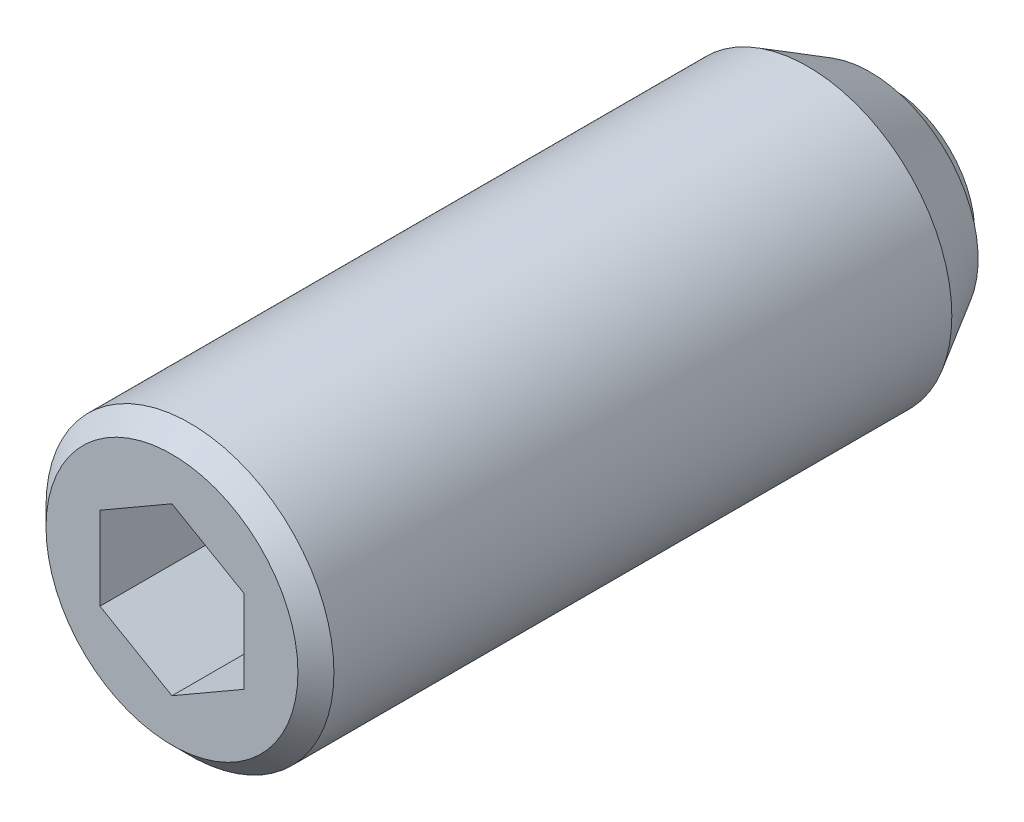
ISO-10303-21;
HEADER;
FILE_DESCRIPTION(('STEP AP214'),'2;1');
FILE_NAME('part.step','',(''),(''),'','','');
FILE_SCHEMA(('AUTOMOTIVE_DESIGN { 1 0 10303 214 1 1 1 1 }'));
ENDSEC;
DATA;
#1=APPLICATION_CONTEXT('core data for automotive mechanical design processes');
#2=APPLICATION_PROTOCOL_DEFINITION('international standard','automotive_design',2000,#1);
#3=PRODUCT_CONTEXT('',#1,'mechanical');
#4=PRODUCT('Part','Part','',(#3));
#5=PRODUCT_RELATED_PRODUCT_CATEGORY('part','',(#4));
#6=PRODUCT_DEFINITION_FORMATION('','',#4);
#7=PRODUCT_DEFINITION_CONTEXT('part definition',#1,'design');
#8=PRODUCT_DEFINITION('design','',#6,#7);
#9=PRODUCT_DEFINITION_SHAPE('','',#8);
#10=(LENGTH_UNIT() NAMED_UNIT(*) SI_UNIT(.MILLI.,.METRE.));
#11=(NAMED_UNIT(*) PLANE_ANGLE_UNIT() SI_UNIT($,.RADIAN.));
#12=(NAMED_UNIT(*) SI_UNIT($,.STERADIAN.) SOLID_ANGLE_UNIT());
#13=UNCERTAINTY_MEASURE_WITH_UNIT(LENGTH_MEASURE(1.E-05),#10,'distance_accuracy_value','');
#14=(GEOMETRIC_REPRESENTATION_CONTEXT(3) GLOBAL_UNCERTAINTY_ASSIGNED_CONTEXT((#13)) GLOBAL_UNIT_ASSIGNED_CONTEXT((#10,
#11,#12)) REPRESENTATION_CONTEXT('',''));
#15=CARTESIAN_POINT('',(0.,0.,0.));
#16=DIRECTION('',(0.,0.,1.));
#17=DIRECTION('',(1.,0.,0.));
#18=AXIS2_PLACEMENT_3D('',#15,#16,#17);
#19=CARTESIAN_POINT('',(2.,1.15470053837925,17.5));
#20=DIRECTION('',(0.5,0.86602540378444,0.));
#21=DIRECTION('',(0.86602540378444,-0.5,0.));
#22=AXIS2_PLACEMENT_3D('',#19,#20,#21);
#23=PLANE('',#22);
#24=DIRECTION('',(0.,0.,1.));
#25=VECTOR('',#24,1.);
#26=CARTESIAN_POINT('',(2.,1.15470053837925,17.5));
#27=LINE('',#26,#25);
#28=CARTESIAN_POINT('',(2.,1.15470053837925,16.));
#29=VERTEX_POINT('',#28);
#30=CARTESIAN_POINT('',(2.,1.15470053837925,20.));
#31=VERTEX_POINT('',#30);
#32=EDGE_CURVE('E68',#29,#31,#27,.T.);
#33=ORIENTED_EDGE('',*,*,#32,.T.);
#34=DIRECTION('',(-0.86602540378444,0.5,0.));
#35=VECTOR('',#34,1.);
#36=CARTESIAN_POINT('',(2.,1.15470053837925,20.));
#37=LINE('',#36,#35);
#38=CARTESIAN_POINT('',(0.,2.3094010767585,20.));
#39=VERTEX_POINT('',#38);
#40=EDGE_CURVE('E29',#31,#39,#37,.T.);
#41=ORIENTED_EDGE('',*,*,#40,.T.);
#42=DIRECTION('',(0.,0.,1.));
#43=VECTOR('',#42,1.);
#44=CARTESIAN_POINT('',(0.,2.3094010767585,17.5));
#45=LINE('',#44,#43);
#46=CARTESIAN_POINT('',(0.,2.3094010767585,16.));
#47=VERTEX_POINT('',#46);
#48=EDGE_CURVE('E80',#47,#39,#45,.T.);
#49=ORIENTED_EDGE('',*,*,#48,.F.);
#50=DIRECTION('',(-0.86602540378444,0.5,0.));
#51=VECTOR('',#50,1.);
#52=CARTESIAN_POINT('',(2.,1.15470053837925,16.));
#53=LINE('',#52,#51);
#54=EDGE_CURVE('E79',#29,#47,#53,.T.);
#55=ORIENTED_EDGE('',*,*,#54,.F.);
#56=EDGE_LOOP('',(#33,#41,#49,#55));
#57=FACE_BOUND('',#56,.T.);
#58=ADVANCED_FACE('F14',(#57),#23,.F.);
#59=CARTESIAN_POINT('',(2.,-1.15470053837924,17.5));
#60=DIRECTION('',(1.,0.,0.));
#61=DIRECTION('',(0.,0.,1.));
#62=AXIS2_PLACEMENT_3D('',#59,#60,#61);
#63=PLANE('',#62);
#64=DIRECTION('',(0.,0.,1.));
#65=VECTOR('',#64,1.);
#66=CARTESIAN_POINT('',(2.,-1.15470053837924,17.5));
#67=LINE('',#66,#65);
#68=CARTESIAN_POINT('',(2.,-1.15470053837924,16.));
#69=VERTEX_POINT('',#68);
#70=CARTESIAN_POINT('',(2.,-1.15470053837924,20.));
#71=VERTEX_POINT('',#70);
#72=EDGE_CURVE('E76',#69,#71,#67,.T.);
#73=ORIENTED_EDGE('',*,*,#72,.T.);
#74=DIRECTION('',(0.,1.,0.));
#75=VECTOR('',#74,1.);
#76=CARTESIAN_POINT('',(2.,-1.15470053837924,20.));
#77=LINE('',#76,#75);
#78=EDGE_CURVE('E75',#71,#31,#77,.T.);
#79=ORIENTED_EDGE('',*,*,#78,.T.);
#80=ORIENTED_EDGE('',*,*,#32,.F.);
#81=DIRECTION('',(0.,1.,0.));
#82=VECTOR('',#81,1.);
#83=CARTESIAN_POINT('',(2.,-1.15470053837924,16.));
#84=LINE('',#83,#82);
#85=EDGE_CURVE('E72',#69,#29,#84,.T.);
#86=ORIENTED_EDGE('',*,*,#85,.F.);
#87=EDGE_LOOP('',(#73,#79,#80,#86));
#88=FACE_BOUND('',#87,.T.);
#89=ADVANCED_FACE('F70',(#88),#63,.F.);
#90=CARTESIAN_POINT('',(2.,-1.15470053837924,17.5));
#91=DIRECTION('',(-0.5,0.866025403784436,0.));
#92=DIRECTION('',(0.866025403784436,0.5,0.));
#93=AXIS2_PLACEMENT_3D('',#90,#91,#92);
#94=PLANE('',#93);
#95=DIRECTION('',(0.,0.,1.));
#96=VECTOR('',#95,1.);
#97=CARTESIAN_POINT('',(0.,-2.30940107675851,17.5));
#98=LINE('',#97,#96);
#99=CARTESIAN_POINT('',(0.,-2.30940107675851,16.));
#100=VERTEX_POINT('',#99);
#101=CARTESIAN_POINT('',(0.,-2.30940107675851,20.));
#102=VERTEX_POINT('',#101);
#103=EDGE_CURVE('E122',#100,#102,#98,.T.);
#104=ORIENTED_EDGE('',*,*,#103,.T.);
#105=DIRECTION('',(-0.866025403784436,-0.5,0.));
#106=VECTOR('',#105,1.);
#107=CARTESIAN_POINT('',(2.,-1.15470053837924,20.));
#108=LINE('',#107,#106);
#109=EDGE_CURVE('E113',#71,#102,#108,.T.);
#110=ORIENTED_EDGE('',*,*,#109,.F.);
#111=ORIENTED_EDGE('',*,*,#72,.F.);
#112=DIRECTION('',(0.866025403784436,0.5,0.));
#113=VECTOR('',#112,1.);
#114=CARTESIAN_POINT('',(0.,-2.30940107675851,16.));
#115=LINE('',#114,#113);
#116=EDGE_CURVE('E89',#100,#69,#115,.T.);
#117=ORIENTED_EDGE('',*,*,#116,.F.);
#118=EDGE_LOOP('',(#104,#110,#111,#117));
#119=FACE_BOUND('',#118,.T.);
#120=ADVANCED_FACE('F147',(#119),#94,.T.);
#121=CARTESIAN_POINT('',(-2.,-1.15470053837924,17.5));
#122=DIRECTION('',(-0.5,-0.866025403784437,0.));
#123=DIRECTION('',(-0.866025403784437,0.5,0.));
#124=AXIS2_PLACEMENT_3D('',#121,#122,#123);
#125=PLANE('',#124);
#126=DIRECTION('',(0.,0.,1.));
#127=VECTOR('',#126,1.);
#128=CARTESIAN_POINT('',(-2.,-1.15470053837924,17.5));
#129=LINE('',#128,#127);
#130=CARTESIAN_POINT('',(-2.,-1.15470053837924,16.));
#131=VERTEX_POINT('',#130);
#132=CARTESIAN_POINT('',(-2.,-1.15470053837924,20.));
#133=VERTEX_POINT('',#132);
#134=EDGE_CURVE('E120',#131,#133,#129,.T.);
#135=ORIENTED_EDGE('',*,*,#134,.T.);
#136=DIRECTION('',(0.866025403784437,-0.5,0.));
#137=VECTOR('',#136,1.);
#138=CARTESIAN_POINT('',(-2.,-1.15470053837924,20.));
#139=LINE('',#138,#137);
#140=EDGE_CURVE('E111',#133,#102,#139,.T.);
#141=ORIENTED_EDGE('',*,*,#140,.T.);
#142=ORIENTED_EDGE('',*,*,#103,.F.);
#143=DIRECTION('',(0.866025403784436,-0.5,0.));
#144=VECTOR('',#143,1.);
#145=CARTESIAN_POINT('',(-2.,-1.15470053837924,16.));
#146=LINE('',#145,#144);
#147=EDGE_CURVE('E101',#131,#100,#146,.T.);
#148=ORIENTED_EDGE('',*,*,#147,.F.);
#149=EDGE_LOOP('',(#135,#141,#142,#148));
#150=FACE_BOUND('',#149,.T.);
#151=ADVANCED_FACE('F157',(#150),#125,.F.);
#152=CARTESIAN_POINT('',(-2.,-1.15470053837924,17.5));
#153=DIRECTION('',(1.,0.,0.));
#154=DIRECTION('',(0.,0.,1.));
#155=AXIS2_PLACEMENT_3D('',#152,#153,#154);
#156=PLANE('',#155);
#157=DIRECTION('',(0.,0.,1.));
#158=VECTOR('',#157,1.);
#159=CARTESIAN_POINT('',(-2.,1.15470053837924,17.5));
#160=LINE('',#159,#158);
#161=CARTESIAN_POINT('',(-2.,1.15470053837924,16.));
#162=VERTEX_POINT('',#161);
#163=CARTESIAN_POINT('',(-2.,1.15470053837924,20.));
#164=VERTEX_POINT('',#163);
#165=EDGE_CURVE('E37',#162,#164,#160,.T.);
#166=ORIENTED_EDGE('',*,*,#165,.T.);
#167=DIRECTION('',(0.,1.,0.));
#168=VECTOR('',#167,1.);
#169=CARTESIAN_POINT('',(-2.,-1.15470053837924,20.));
#170=LINE('',#169,#168);
#171=EDGE_CURVE('E108',#133,#164,#170,.T.);
#172=ORIENTED_EDGE('',*,*,#171,.F.);
#173=ORIENTED_EDGE('',*,*,#134,.F.);
#174=DIRECTION('',(0.,-1.,0.));
#175=VECTOR('',#174,1.);
#176=CARTESIAN_POINT('',(-2.,1.15470053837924,16.));
#177=LINE('',#176,#175);
#178=EDGE_CURVE('E98',#162,#131,#177,.T.);
#179=ORIENTED_EDGE('',*,*,#178,.F.);
#180=EDGE_LOOP('',(#166,#172,#173,#179));
#181=FACE_BOUND('',#180,.T.);
#182=ADVANCED_FACE('F153',(#181),#156,.T.);
#183=CARTESIAN_POINT('',(-2.,1.15470053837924,17.5));
#184=DIRECTION('',(0.5,-0.866025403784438,0.));
#185=DIRECTION('',(-0.866025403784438,-0.5,0.));
#186=AXIS2_PLACEMENT_3D('',#183,#184,#185);
#187=PLANE('',#186);
#188=ORIENTED_EDGE('',*,*,#165,.F.);
#189=DIRECTION('',(-0.866025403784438,-0.5,0.));
#190=VECTOR('',#189,1.);
#191=CARTESIAN_POINT('',(0.,2.3094010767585,16.));
#192=LINE('',#191,#190);
#193=EDGE_CURVE('E84',#47,#162,#192,.T.);
#194=ORIENTED_EDGE('',*,*,#193,.F.);
#195=ORIENTED_EDGE('',*,*,#48,.T.);
#196=DIRECTION('',(0.866025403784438,0.5,0.));
#197=VECTOR('',#196,1.);
#198=CARTESIAN_POINT('',(-2.,1.15470053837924,20.));
#199=LINE('',#198,#197);
#200=EDGE_CURVE('E105',#164,#39,#199,.T.);
#201=ORIENTED_EDGE('',*,*,#200,.F.);
#202=EDGE_LOOP('',(#188,#194,#195,#201));
#203=FACE_BOUND('',#202,.T.);
#204=ADVANCED_FACE('F150',(#203),#187,.T.);
#205=CARTESIAN_POINT('',(0.,0.,19.75));
#206=DIRECTION('',(0.,0.,-1.));
#207=DIRECTION('',(1.,0.,0.));
#208=AXIS2_PLACEMENT_3D('',#205,#206,#207);
#209=CYLINDRICAL_SURFACE('',#208,4.);
#210=CARTESIAN_POINT('',(0.,0.,19.5));
#211=DIRECTION('',(0.,0.,-1.));
#212=DIRECTION('',(1.,0.,0.));
#213=AXIS2_PLACEMENT_3D('',#210,#211,#212);
#214=CIRCLE('',#213,4.);
#215=CARTESIAN_POINT('',(4.,0.,19.5));
#216=VERTEX_POINT('',#215);
#217=EDGE_CURVE('E9',#216,#216,#214,.T.);
#218=ORIENTED_EDGE('',*,*,#217,.T.);
#219=EDGE_LOOP('',(#218));
#220=FACE_BOUND('',#219,.T.);
#221=CARTESIAN_POINT('',(0.,0.,2.33205080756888));
#222=DIRECTION('',(0.,0.,-1.));
#223=DIRECTION('',(-1.,0.,0.));
#224=AXIS2_PLACEMENT_3D('',#221,#222,#223);
#225=CIRCLE('',#224,4.);
#226=CARTESIAN_POINT('',(-4.,0.,2.33205080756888));
#227=VERTEX_POINT('',#226);
#228=EDGE_CURVE('E260',#227,#227,#225,.T.);
#229=ORIENTED_EDGE('',*,*,#228,.F.);
#230=EDGE_LOOP('',(#229));
#231=FACE_BOUND('',#230,.T.);
#232=ADVANCED_FACE('F16',(#220,#231),#209,.T.);
#233=CARTESIAN_POINT('',(0.,0.,19.5));
#234=DIRECTION('',(0.,0.,-1.));
#235=DIRECTION('',(1.,0.,0.));
#236=AXIS2_PLACEMENT_3D('',#233,#234,#235);
#237=CONICAL_SURFACE('',#236,4.,0.785398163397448);
#238=CARTESIAN_POINT('',(0.,0.,20.));
#239=DIRECTION('',(0.,0.,-1.));
#240=DIRECTION('',(1.,0.,0.));
#241=AXIS2_PLACEMENT_3D('',#238,#239,#240);
#242=CIRCLE('',#241,3.5);
#243=CARTESIAN_POINT('',(3.5,0.,20.));
#244=VERTEX_POINT('',#243);
#245=EDGE_CURVE('E22',#244,#244,#242,.T.);
#246=ORIENTED_EDGE('',*,*,#245,.T.);
#247=EDGE_LOOP('',(#246));
#248=FACE_BOUND('',#247,.T.);
#249=ORIENTED_EDGE('',*,*,#217,.F.);
#250=EDGE_LOOP('',(#249));
#251=FACE_BOUND('',#250,.T.);
#252=ADVANCED_FACE('F127',(#248,#251),#237,.T.);
#253=CARTESIAN_POINT('',(0.,0.,20.));
#254=DIRECTION('',(0.,0.,-1.));
#255=DIRECTION('',(1.,0.,0.));
#256=AXIS2_PLACEMENT_3D('',#253,#254,#255);
#257=PLANE('',#256);
#258=ORIENTED_EDGE('',*,*,#200,.T.);
#259=ORIENTED_EDGE('',*,*,#40,.F.);
#260=ORIENTED_EDGE('',*,*,#78,.F.);
#261=ORIENTED_EDGE('',*,*,#109,.T.);
#262=ORIENTED_EDGE('',*,*,#140,.F.);
#263=ORIENTED_EDGE('',*,*,#171,.T.);
#264=EDGE_LOOP('',(#258,#259,#260,#261,#262,#263));
#265=FACE_BOUND('',#264,.T.);
#266=ORIENTED_EDGE('',*,*,#245,.F.);
#267=EDGE_LOOP('',(#266));
#268=FACE_BOUND('',#267,.T.);
#269=ADVANCED_FACE('F130',(#265,#268),#257,.F.);
#270=CARTESIAN_POINT('',(2.,1.15470053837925,16.));
#271=DIRECTION('',(0.,0.,1.));
#272=DIRECTION('',(1.,0.,0.));
#273=AXIS2_PLACEMENT_3D('',#270,#271,#272);
#274=PLANE('',#273);
#275=ORIENTED_EDGE('',*,*,#85,.T.);
#276=ORIENTED_EDGE('',*,*,#54,.T.);
#277=ORIENTED_EDGE('',*,*,#193,.T.);
#278=ORIENTED_EDGE('',*,*,#178,.T.);
#279=ORIENTED_EDGE('',*,*,#147,.T.);
#280=ORIENTED_EDGE('',*,*,#116,.T.);
#281=EDGE_LOOP('',(#275,#276,#277,#278,#279,#280));
#282=FACE_BOUND('',#281,.T.);
#283=ADVANCED_FACE('F86',(#282),#274,.T.);
#284=CARTESIAN_POINT('',(0.,0.,0.));
#285=DIRECTION('',(0.,0.,-1.));
#286=DIRECTION('',(-1.,0.,0.));
#287=AXIS2_PLACEMENT_3D('',#284,#285,#286);
#288=PLANE('',#287);
#289=CARTESIAN_POINT('',(0.,0.,0.));
#290=DIRECTION('',(0.,0.,-1.));
#291=DIRECTION('',(-1.,0.,0.));
#292=AXIS2_PLACEMENT_3D('',#289,#290,#291);
#293=CIRCLE('',#292,2.30488611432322);
#294=CARTESIAN_POINT('',(-2.30488611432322,0.,0.));
#295=VERTEX_POINT('',#294);
#296=EDGE_CURVE('E90',#295,#295,#293,.T.);
#297=ORIENTED_EDGE('',*,*,#296,.T.);
#298=EDGE_LOOP('',(#297));
#299=FACE_BOUND('',#298,.T.);
#300=ADVANCED_FACE('F139',(#299),#288,.T.);
#301=CARTESIAN_POINT('',(0.,0.,1.5));
#302=DIRECTION('',(0.,0.,-1.));
#303=DIRECTION('',(-1.,0.,0.));
#304=AXIS2_PLACEMENT_3D('',#301,#302,#303);
#305=SPHERICAL_SURFACE('',#304,2.75);
#306=CARTESIAN_POINT('',(0.,0.,0.6));
#307=DIRECTION('',(0.,0.,-1.));
#308=DIRECTION('',(-1.,0.,0.));
#309=AXIS2_PLACEMENT_3D('',#306,#307,#308);
#310=CIRCLE('',#309,2.59855729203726);
#311=CARTESIAN_POINT('',(-2.59855729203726,0.,0.6));
#312=VERTEX_POINT('',#311);
#313=EDGE_CURVE('E93',#312,#312,#310,.T.);
#314=CARTESIAN_POINT('',(-2.59855729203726,0.,0.6));
#315=CARTESIAN_POINT('',(-2.59627433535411,0.,0.593408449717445));
#316=CARTESIAN_POINT('',(-2.59396629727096,0.,0.586825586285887));
#317=CARTESIAN_POINT('',(-2.58930019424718,0.,0.573677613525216));
#318=CARTESIAN_POINT('',(-2.58694212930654,0.,0.567112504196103));
#319=CARTESIAN_POINT('',(-2.58217610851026,0.,0.55400042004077));
#320=CARTESIAN_POINT('',(-2.57976815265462,0.,0.54745344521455));
#321=CARTESIAN_POINT('',(-2.57490248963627,0.,0.534378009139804));
#322=CARTESIAN_POINT('',(-2.57244478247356,0.,0.527849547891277));
#323=CARTESIAN_POINT('',(-2.56747975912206,0.,0.514811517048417));
#324=CARTESIAN_POINT('',(-2.56497244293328,0.,0.508301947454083));
#325=CARTESIAN_POINT('',(-2.55990834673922,0.,0.495302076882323));
#326=CARTESIAN_POINT('',(-2.55735156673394,0.,0.488811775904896));
#327=CARTESIAN_POINT('',(-2.55218869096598,0.,0.475850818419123));
#328=CARTESIAN_POINT('',(-2.54958259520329,0.,0.469380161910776));
#329=CARTESIAN_POINT('',(-2.54432123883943,0.,0.456458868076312));
#330=CARTESIAN_POINT('',(-2.54166597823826,0.,0.450008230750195));
#331=CARTESIAN_POINT('',(-2.53630644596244,0.,0.437127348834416));
#332=CARTESIAN_POINT('',(-2.53360217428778,0.,0.430697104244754));
#333=CARTESIAN_POINT('',(-2.52814477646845,0.,0.417857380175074));
#334=CARTESIAN_POINT('',(-2.52539165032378,0.,0.411447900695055));
#335=CARTESIAN_POINT('',(-2.51983670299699,0.,0.398650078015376));
#336=CARTESIAN_POINT('',(-2.51703488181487,0.,0.392261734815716));
#337=CARTESIAN_POINT('',(-2.51138270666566,0.,0.379506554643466));
#338=CARTESIAN_POINT('',(-2.50853235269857,0.,0.373139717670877));
#339=CARTESIAN_POINT('',(-2.50278327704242,0.,0.360427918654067));
#340=CARTESIAN_POINT('',(-2.49988455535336,0.,0.354082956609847));
#341=CARTESIAN_POINT('',(-2.49403891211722,0.,0.3414152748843));
#342=CARTESIAN_POINT('',(-2.49109199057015,0.,0.335092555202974));
#343=CARTESIAN_POINT('',(-2.48515011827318,0.,0.322469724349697));
#344=CARTESIAN_POINT('',(-2.48215516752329,0.,0.316169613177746));
#345=CARTESIAN_POINT('',(-2.47611741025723,0.,0.303592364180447));
#346=CARTESIAN_POINT('',(-2.47307460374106,0.,0.2973152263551));
#347=CARTESIAN_POINT('',(-2.46694131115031,0.,0.284784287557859));
#348=CARTESIAN_POINT('',(-2.46385082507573,0.,0.278530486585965));
#349=CARTESIAN_POINT('',(-2.45762235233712,0.,0.266046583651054));
#350=CARTESIAN_POINT('',(-2.45448436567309,0.,0.259816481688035));
#351=CARTESIAN_POINT('',(-2.44816107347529,0.,0.247380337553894));
#352=CARTESIAN_POINT('',(-2.44497576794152,0.,0.241174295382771));
#353=CARTESIAN_POINT('',(-2.43855802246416,0.,0.228786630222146));
#354=CARTESIAN_POINT('',(-2.43532558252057,0.,0.222605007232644));
#355=CARTESIAN_POINT('',(-2.42881375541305,0.,0.210266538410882));
#356=CARTESIAN_POINT('',(-2.42553436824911,0.,0.204109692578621));
#357=CARTESIAN_POINT('',(-2.41892883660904,0.,0.191821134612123));
#358=CARTESIAN_POINT('',(-2.41560269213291,0.,0.185689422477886));
#359=CARTESIAN_POINT('',(-2.40890383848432,0.,0.173451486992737));
#360=CARTESIAN_POINT('',(-2.40553112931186,0.,0.167345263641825));
#361=CARTESIAN_POINT('',(-2.39873934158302,0.,0.155158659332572));
#362=CARTESIAN_POINT('',(-2.39532026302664,0.,0.149078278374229));
#363=CARTESIAN_POINT('',(-2.38843593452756,0.,0.136943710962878));
#364=CARTESIAN_POINT('',(-2.38497068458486,0.,0.13088952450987));
#365=CARTESIAN_POINT('',(-2.37799421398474,0.,0.11880769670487));
#366=CARTESIAN_POINT('',(-2.37448299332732,0.,0.11278005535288));
#367=CARTESIAN_POINT('',(-2.36741478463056,0.,0.100751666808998));
#368=CARTESIAN_POINT('',(-2.36385779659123,0.,0.094750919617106));
#369=CARTESIAN_POINT('',(-2.35669825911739,0.,0.0827766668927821));
#370=CARTESIAN_POINT('',(-2.35309570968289,0.,0.0768031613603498));
#371=CARTESIAN_POINT('',(-2.34584525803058,0.,0.0648837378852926));
#372=CARTESIAN_POINT('',(-2.34219735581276,0.,0.0589378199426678));
#373=CARTESIAN_POINT('',(-2.33485640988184,0.,0.0470739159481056));
#374=CARTESIAN_POINT('',(-2.33116336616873,0.,0.0411559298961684));
#375=CARTESIAN_POINT('',(-2.32373235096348,0.,0.0293482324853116));
#376=CARTESIAN_POINT('',(-2.31999437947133,0.,0.023458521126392));
#377=CARTESIAN_POINT('',(-2.31247372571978,0.,0.0117077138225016));
#378=CARTESIAN_POINT('',(-2.30869104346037,0.,0.00584661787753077));
#379=CARTESIAN_POINT('',(-2.30488611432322,0.,0.));
#380=B_SPLINE_CURVE_WITH_KNOTS('',3,(#314,#315,#316,#317,#318,#319,#320,#321,#322,#323,#324,
#325,#326,#327,#328,#329,#330,#331,#332,#333,#334,#335,#336,#337,#338,#339,#340,#341,#342,#343,
#344,#345,#346,#347,#348,#349,#350,#351,#352,#353,#354,#355,#356,#357,#358,#359,#360,#361,#362,
#363,#364,#365,#366,#367,#368,#369,#370,#371,#372,#373,#374,#375,#376,#377,#378,#379),
.UNSPECIFIED.,.F.,.F.,(4,2,2,2,2,2,2,2,2,2,2,2,2,2,2,2,2,2,2,2,2,2,2,2,2,2,2,2,2,2,2,2,4),(0.,
0.0209270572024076,0.0418541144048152,0.0627811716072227,0.0837082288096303,0.104635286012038,
0.125562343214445,0.146489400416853,0.16741645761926,0.188343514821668,0.209270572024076,
0.230197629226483,0.251124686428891,0.272051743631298,0.292978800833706,0.313905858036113,
0.334832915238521,0.355759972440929,0.376687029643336,0.397614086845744,0.418541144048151,
0.439468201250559,0.460395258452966,0.481322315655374,0.502249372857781,0.523176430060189,
0.544103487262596,0.565030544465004,0.585957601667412,0.606884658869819,0.627811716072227,
0.648738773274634,0.669665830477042),.UNSPECIFIED.);
#381=EDGE_CURVE('BSEAM223',#312,#295,#380,.T.);
#382=ORIENTED_EDGE('',*,*,#313,.T.);
#383=ORIENTED_EDGE('',*,*,#296,.F.);
#384=ORIENTED_EDGE('',*,*,#381,.T.);
#385=ORIENTED_EDGE('',*,*,#381,.F.);
#386=EDGE_LOOP('',(#382,#384,#383,#385));
#387=FACE_BOUND('',#386,.T.);
#388=ADVANCED_FACE('F223',(#387),#305,.T.);
#389=CARTESIAN_POINT('',(-2.59855729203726,0.,0.6));
#390=DIRECTION('',(0.,0.,-1.));
#391=DIRECTION('',(-1.,0.,0.));
#392=AXIS2_PLACEMENT_3D('',#389,#390,#391);
#393=PLANE('',#392);
#394=CARTESIAN_POINT('',(0.,0.,0.6));
#395=DIRECTION('',(0.,0.,-1.));
#396=DIRECTION('',(-1.,0.,0.));
#397=AXIS2_PLACEMENT_3D('',#394,#395,#396);
#398=CIRCLE('',#397,3.);
#399=CARTESIAN_POINT('',(-3.,0.,0.6));
#400=VERTEX_POINT('',#399);
#401=EDGE_CURVE('E263',#400,#400,#398,.T.);
#402=ORIENTED_EDGE('',*,*,#401,.T.);
#403=EDGE_LOOP('',(#402));
#404=FACE_BOUND('',#403,.T.);
#405=ORIENTED_EDGE('',*,*,#313,.F.);
#406=EDGE_LOOP('',(#405));
#407=FACE_BOUND('',#406,.T.);
#408=ADVANCED_FACE('F232',(#404,#407),#393,.T.);
#409=CARTESIAN_POINT('',(0.,0.,0.6));
#410=DIRECTION('',(0.,0.,1.));
#411=DIRECTION('',(1.,0.,0.));
#412=AXIS2_PLACEMENT_3D('',#409,#410,#411);
#413=CONICAL_SURFACE('',#412,3.,0.523598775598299);
#414=ORIENTED_EDGE('',*,*,#228,.T.);
#415=EDGE_LOOP('',(#414));
#416=FACE_BOUND('',#415,.T.);
#417=ORIENTED_EDGE('',*,*,#401,.F.);
#418=EDGE_LOOP('',(#417));
#419=FACE_BOUND('',#418,.T.);
#420=ADVANCED_FACE('F242',(#416,#419),#413,.T.);
#421=CLOSED_SHELL('',(#58,#89,#120,#151,#182,#204,#232,#252,#269,#283,#300,#388,#408,#420));
#422=MANIFOLD_SOLID_BREP('B1',#421);
#423=ADVANCED_BREP_SHAPE_REPRESENTATION('',(#18,#422),#14);
#424=SHAPE_DEFINITION_REPRESENTATION(#9,#423);
ENDSEC;
END-ISO-10303-21;
